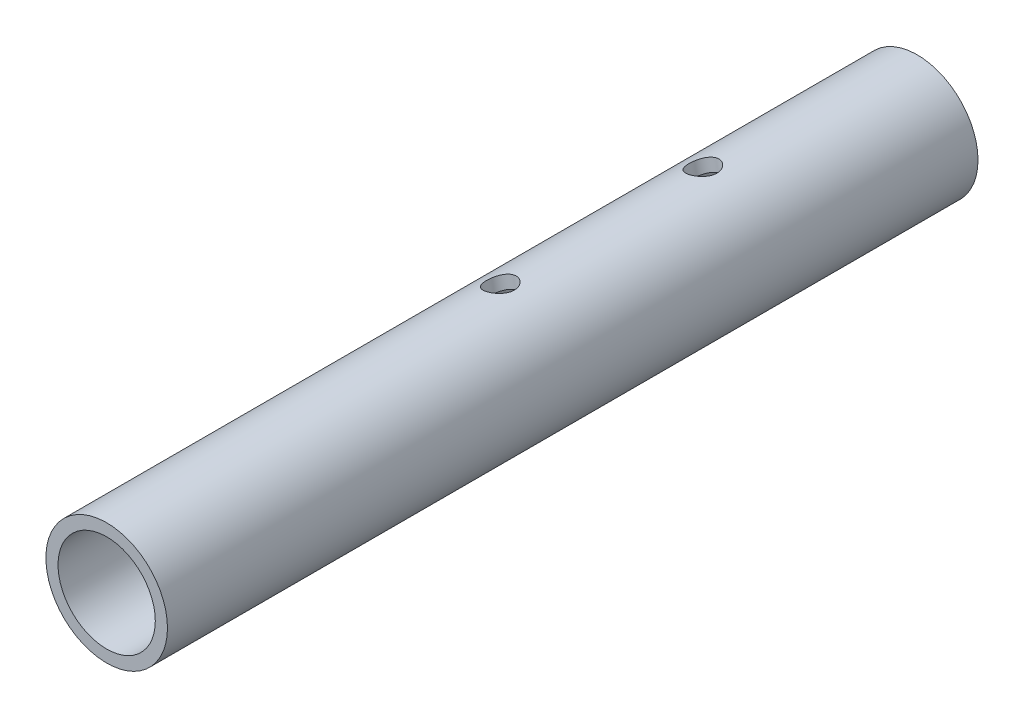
ISO-10303-21;
HEADER;
FILE_DESCRIPTION(('STEP AP214'),'2;1');
FILE_NAME('part.step','',(''),(''),'','','');
FILE_SCHEMA(('AUTOMOTIVE_DESIGN { 1 0 10303 214 1 1 1 1 }'));
ENDSEC;
DATA;
#1=APPLICATION_CONTEXT('core data for automotive mechanical design processes');
#2=APPLICATION_PROTOCOL_DEFINITION('international standard','automotive_design',2000,#1);
#3=PRODUCT_CONTEXT('',#1,'mechanical');
#4=PRODUCT('Part','Part','',(#3));
#5=PRODUCT_RELATED_PRODUCT_CATEGORY('part','',(#4));
#6=PRODUCT_DEFINITION_FORMATION('','',#4);
#7=PRODUCT_DEFINITION_CONTEXT('part definition',#1,'design');
#8=PRODUCT_DEFINITION('design','',#6,#7);
#9=PRODUCT_DEFINITION_SHAPE('','',#8);
#10=(LENGTH_UNIT() NAMED_UNIT(*) SI_UNIT(.MILLI.,.METRE.));
#11=(NAMED_UNIT(*) PLANE_ANGLE_UNIT() SI_UNIT($,.RADIAN.));
#12=(NAMED_UNIT(*) SI_UNIT($,.STERADIAN.) SOLID_ANGLE_UNIT());
#13=UNCERTAINTY_MEASURE_WITH_UNIT(LENGTH_MEASURE(1.E-05),#10,'distance_accuracy_value','');
#14=(GEOMETRIC_REPRESENTATION_CONTEXT(3) GLOBAL_UNCERTAINTY_ASSIGNED_CONTEXT((#13)) GLOBAL_UNIT_ASSIGNED_CONTEXT((#10,
#11,#12)) REPRESENTATION_CONTEXT('',''));
#15=CARTESIAN_POINT('',(0.,0.,0.));
#16=DIRECTION('',(0.,0.,1.));
#17=DIRECTION('',(1.,0.,0.));
#18=AXIS2_PLACEMENT_3D('',#15,#16,#17);
#19=CARTESIAN_POINT('',(-10.4241869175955,-1.53847980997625,200.));
#20=DIRECTION('',(0.,0.,1.));
#21=DIRECTION('',(1.,0.,0.));
#22=AXIS2_PLACEMENT_3D('',#19,#20,#21);
#23=PLANE('',#22);
#24=CARTESIAN_POINT('',(-10.4241869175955,-1.53847980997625,200.));
#25=DIRECTION('',(0.,0.,1.));
#26=DIRECTION('',(1.,0.,0.));
#27=AXIS2_PLACEMENT_3D('',#24,#25,#26);
#28=CIRCLE('',#27,15.);
#29=CARTESIAN_POINT('',(4.5758130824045,-1.53847980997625,200.));
#30=VERTEX_POINT('',#29);
#31=EDGE_CURVE('E10',#30,#30,#28,.T.);
#32=ORIENTED_EDGE('',*,*,#31,.T.);
#33=EDGE_LOOP('',(#32));
#34=FACE_BOUND('',#33,.T.);
#35=CARTESIAN_POINT('',(-10.4241869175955,-1.53847980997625,200.));
#36=DIRECTION('',(0.,0.,1.));
#37=DIRECTION('',(1.,0.,0.));
#38=AXIS2_PLACEMENT_3D('',#35,#36,#37);
#39=CIRCLE('',#38,12.);
#40=CARTESIAN_POINT('',(1.5758130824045,-1.53847980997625,200.));
#41=VERTEX_POINT('',#40);
#42=EDGE_CURVE('E46',#41,#41,#39,.T.);
#43=ORIENTED_EDGE('',*,*,#42,.F.);
#44=EDGE_LOOP('',(#43));
#45=FACE_BOUND('',#44,.T.);
#46=ADVANCED_FACE('F28',(#34,#45),#23,.T.);
#47=CARTESIAN_POINT('',(-10.4241869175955,-1.53847980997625,0.));
#48=DIRECTION('',(0.,0.,1.));
#49=DIRECTION('',(1.,0.,0.));
#50=AXIS2_PLACEMENT_3D('',#47,#48,#49);
#51=PLANE('',#50);
#52=CARTESIAN_POINT('',(-10.4241869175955,-1.53847980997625,0.));
#53=DIRECTION('',(0.,0.,1.));
#54=DIRECTION('',(1.,0.,0.));
#55=AXIS2_PLACEMENT_3D('',#52,#53,#54);
#56=CIRCLE('',#55,15.);
#57=CARTESIAN_POINT('',(4.5758130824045,-1.53847980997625,0.));
#58=VERTEX_POINT('',#57);
#59=EDGE_CURVE('E41',#58,#58,#56,.T.);
#60=ORIENTED_EDGE('',*,*,#59,.F.);
#61=EDGE_LOOP('',(#60));
#62=FACE_BOUND('',#61,.T.);
#63=CARTESIAN_POINT('',(-10.4241869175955,-1.53847980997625,0.));
#64=DIRECTION('',(0.,0.,1.));
#65=DIRECTION('',(1.,0.,0.));
#66=AXIS2_PLACEMENT_3D('',#63,#64,#65);
#67=CIRCLE('',#66,12.);
#68=CARTESIAN_POINT('',(1.5758130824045,-1.53847980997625,0.));
#69=VERTEX_POINT('',#68);
#70=EDGE_CURVE('E49',#69,#69,#67,.T.);
#71=ORIENTED_EDGE('',*,*,#70,.T.);
#72=EDGE_LOOP('',(#71));
#73=FACE_BOUND('',#72,.T.);
#74=ADVANCED_FACE('F96',(#62,#73),#51,.F.);
#75=CARTESIAN_POINT('',(-10.4241869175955,-1.53847980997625,200.));
#76=DIRECTION('',(0.,0.,-1.));
#77=DIRECTION('',(-1.,0.,0.));
#78=AXIS2_PLACEMENT_3D('',#75,#76,#77);
#79=CYLINDRICAL_SURFACE('',#78,15.);
#80=CARTESIAN_POINT('',(-9.83998223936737,13.4501393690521,50.));
#81=CARTESIAN_POINT('',(-9.83998905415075,13.4501419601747,50.1937031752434));
#82=CARTESIAN_POINT('',(-9.85656845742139,13.4508140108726,50.3874778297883));
#83=CARTESIAN_POINT('',(-9.92229594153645,13.4531561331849,50.7694922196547));
#84=CARTESIAN_POINT('',(-9.97146548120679,13.4548268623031,50.9577282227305));
#85=CARTESIAN_POINT('',(-10.1005320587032,13.4581658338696,51.3230843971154));
#86=CARTESIAN_POINT('',(-10.1803927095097,13.4598340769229,51.5002174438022));
#87=CARTESIAN_POINT('',(-10.3681859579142,13.4617083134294,51.8388950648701));
#88=CARTESIAN_POINT('',(-10.4761187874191,13.4619142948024,52.0004395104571));
#89=CARTESIAN_POINT('',(-10.718856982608,13.4591238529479,52.3064561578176));
#90=CARTESIAN_POINT('',(-10.8540943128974,13.4560720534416,52.4505852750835));
#91=CARTESIAN_POINT('',(-11.1462470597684,13.4448430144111,52.7146672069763));
#92=CARTESIAN_POINT('',(-11.30316430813,13.4366653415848,52.8346179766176));
#93=CARTESIAN_POINT('',(-11.6361929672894,13.4134161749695,53.0483164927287));
#94=CARTESIAN_POINT('',(-11.8125128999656,13.3982627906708,53.1417310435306));
#95=CARTESIAN_POINT('',(-12.1775393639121,13.359821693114,53.2975449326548));
#96=CARTESIAN_POINT('',(-12.3662443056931,13.3365350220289,53.359948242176));
#97=CARTESIAN_POINT('',(-12.7469089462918,13.2818192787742,53.4508801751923));
#98=CARTESIAN_POINT('',(-12.9387514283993,13.2505420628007,53.4799903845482));
#99=CARTESIAN_POINT('',(-13.32313110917,13.1800214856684,53.5053314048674));
#100=CARTESIAN_POINT('',(-13.5156682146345,13.140779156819,53.5015664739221));
#101=CARTESIAN_POINT('',(-13.8920620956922,13.0563941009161,53.4616905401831));
#102=CARTESIAN_POINT('',(-14.0760147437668,13.0113802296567,53.4262067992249));
#103=CARTESIAN_POINT('',(-14.4341227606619,12.9167868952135,53.3249039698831));
#104=CARTESIAN_POINT('',(-14.6082776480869,12.8672072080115,53.2590833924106));
#105=CARTESIAN_POINT('',(-14.9437099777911,12.7655372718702,53.0984420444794));
#106=CARTESIAN_POINT('',(-15.1048713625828,12.7134299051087,53.0033901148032));
#107=CARTESIAN_POINT('',(-15.4088756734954,12.6099724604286,52.7871578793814));
#108=CARTESIAN_POINT('',(-15.5517157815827,12.5586225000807,52.6659735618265));
#109=CARTESIAN_POINT('',(-15.8189204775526,12.4585810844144,52.3975246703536));
#110=CARTESIAN_POINT('',(-15.9427685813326,12.4099811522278,52.2497113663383));
#111=CARTESIAN_POINT('',(-16.1648533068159,12.3200607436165,51.933976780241));
#112=CARTESIAN_POINT('',(-16.2630890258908,12.2787405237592,51.7660547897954));
#113=CARTESIAN_POINT('',(-16.431780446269,12.2062399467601,51.4139407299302));
#114=CARTESIAN_POINT('',(-16.5021304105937,12.175098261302,51.2296899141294));
#115=CARTESIAN_POINT('',(-16.6125551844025,12.1256263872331,50.8506990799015));
#116=CARTESIAN_POINT('',(-16.6526355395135,12.1072938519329,50.6559609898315));
#117=CARTESIAN_POINT('',(-16.7007781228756,12.0852162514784,50.2663477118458));
#118=CARTESIAN_POINT('',(-16.7095591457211,12.081143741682,50.071579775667));
#119=CARTESIAN_POINT('',(-16.6968479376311,12.0870026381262,49.683258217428));
#120=CARTESIAN_POINT('',(-16.6753581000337,12.0969329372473,49.489704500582));
#121=CARTESIAN_POINT('',(-16.6032479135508,12.1297579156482,49.1120624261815));
#122=CARTESIAN_POINT('',(-16.5530343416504,12.1524714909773,48.9278802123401));
#123=CARTESIAN_POINT('',(-16.4251452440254,12.20900566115,48.5711259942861));
#124=CARTESIAN_POINT('',(-16.3474667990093,12.2428274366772,48.398555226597));
#125=CARTESIAN_POINT('',(-16.1650090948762,12.3198353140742,48.0666264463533));
#126=CARTESIAN_POINT('',(-16.0597835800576,12.3631735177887,47.9075491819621));
#127=CARTESIAN_POINT('',(-15.825416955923,12.4558962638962,47.610107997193));
#128=CARTESIAN_POINT('',(-15.6962724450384,12.5052816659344,47.4717470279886));
#129=CARTESIAN_POINT('',(-15.4140349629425,12.6080536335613,47.2166229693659));
#130=CARTESIAN_POINT('',(-15.2604871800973,12.6615033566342,47.100387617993));
#131=CARTESIAN_POINT('',(-14.9353056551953,12.7681285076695,46.896614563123));
#132=CARTESIAN_POINT('',(-14.7636728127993,12.8213039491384,46.8090754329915));
#133=CARTESIAN_POINT('',(-14.4080228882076,12.9239902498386,46.6658852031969));
#134=CARTESIAN_POINT('',(-14.2240996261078,12.9735239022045,46.6100178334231));
#135=CARTESIAN_POINT('',(-13.8479495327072,13.0668397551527,46.5310920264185));
#136=CARTESIAN_POINT('',(-13.6557240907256,13.1106229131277,46.5080281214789));
#137=CARTESIAN_POINT('',(-13.2732187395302,13.1897335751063,46.495637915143));
#138=CARTESIAN_POINT('',(-13.0830000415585,13.2252363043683,46.5055279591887));
#139=CARTESIAN_POINT('',(-12.7055607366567,13.2882510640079,46.5569930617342));
#140=CARTESIAN_POINT('',(-12.5183400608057,13.3157632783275,46.5985673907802));
#141=CARTESIAN_POINT('',(-12.1530623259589,13.3626875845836,46.7118242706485));
#142=CARTESIAN_POINT('',(-11.9749706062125,13.3821326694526,46.7833817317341));
#143=CARTESIAN_POINT('',(-11.6320749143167,13.4138006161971,46.9544565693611));
#144=CARTESIAN_POINT('',(-11.4672724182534,13.4260226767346,47.0539770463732));
#145=CARTESIAN_POINT('',(-11.1521415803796,13.4446958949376,47.2806336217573));
#146=CARTESIAN_POINT('',(-11.0021958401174,13.4510187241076,47.4083122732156));
#147=CARTESIAN_POINT('',(-10.7251242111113,13.4591431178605,47.686584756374));
#148=CARTESIAN_POINT('',(-10.5980039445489,13.4609435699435,47.8371842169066));
#149=CARTESIAN_POINT('',(-10.3686238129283,13.4618638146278,48.1598665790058));
#150=CARTESIAN_POINT('',(-10.2667851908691,13.4609411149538,48.3322494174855));
#151=CARTESIAN_POINT('',(-10.0940617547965,13.4581376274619,48.6917810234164));
#152=CARTESIAN_POINT('',(-10.023152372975,13.4562576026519,48.8789179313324));
#153=CARTESIAN_POINT('',(-9.92630325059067,13.453314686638,49.2216875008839));
#154=CARTESIAN_POINT('',(-9.8940059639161,13.4521630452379,49.3755530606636));
#155=CARTESIAN_POINT('',(-9.85084337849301,13.4505743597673,49.6862635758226));
#156=CARTESIAN_POINT('',(-9.83997671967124,13.4501372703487,49.8431083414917));
#157=CARTESIAN_POINT('',(-9.83998223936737,13.4501393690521,50.));
#158=B_SPLINE_CURVE_WITH_KNOTS('',3,(#80,#81,#82,#83,#84,#85,#86,#87,#88,#89,#90,#91,#92,#93,
#94,#95,#96,#97,#98,#99,#100,#101,#102,#103,#104,#105,#106,#107,#108,#109,#110,#111,#112,#113,
#114,#115,#116,#117,#118,#119,#120,#121,#122,#123,#124,#125,#126,#127,#128,#129,#130,#131,#132,
#133,#134,#135,#136,#137,#138,#139,#140,#141,#142,#143,#144,#145,#146,#147,#148,#149,#150,#151,
#152,#153,#154,#155,#156,#157),.UNSPECIFIED.,.T.,.F.,(4,2,2,2,2,2,2,2,2,2,2,2,2,2,2,2,2,2,2,2,2,
2,2,2,2,2,2,2,2,2,2,2,2,2,2,2,2,2,4),(0.,0.580534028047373,1.16145068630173,1.7416807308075,
2.32191556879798,2.91217274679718,3.50247982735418,4.09990075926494,4.69724516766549,
5.28398725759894,5.87065335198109,6.44596825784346,7.02131140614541,7.60132670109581,
8.18143110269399,8.7752467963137,9.36908341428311,9.96515067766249,10.5611087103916,
11.1432889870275,11.7254232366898,12.2995106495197,12.873659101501,13.457755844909,
14.0419357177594,14.6386632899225,15.2353611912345,15.8279338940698,16.4204078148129,
16.9988940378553,17.5773669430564,18.1534501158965,18.7295971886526,19.3180036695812,
19.9065548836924,20.5043382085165,21.1016458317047,21.5718845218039,22.0420933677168),.UNSPECIFIED.);
#159=CARTESIAN_POINT('',(-9.83998223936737,13.4501393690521,50.));
#160=VERTEX_POINT('',#159);
#161=EDGE_CURVE('E59',#160,#160,#158,.T.);
#162=ORIENTED_EDGE('',*,*,#161,.T.);
#163=EDGE_LOOP('',(#162));
#164=FACE_BOUND('',#163,.T.);
#165=CARTESIAN_POINT('',(-4.1431649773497,-15.1601083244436,50.));
#166=CARTESIAN_POINT('',(-4.14317027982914,-15.1601133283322,49.8062968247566));
#167=CARTESIAN_POINT('',(-4.15822771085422,-15.1670848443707,49.6125221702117));
#168=CARTESIAN_POINT('',(-4.21804488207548,-15.1944251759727,49.2305077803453));
#169=CARTESIAN_POINT('',(-4.26282419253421,-15.214802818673,49.0422717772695));
#170=CARTESIAN_POINT('',(-4.38076761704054,-15.2673259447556,48.6769156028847));
#171=CARTESIAN_POINT('',(-4.4538981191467,-15.299457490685,48.4997825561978));
#172=CARTESIAN_POINT('',(-4.62665008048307,-15.3731227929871,48.1611049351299));
#173=CARTESIAN_POINT('',(-4.72627175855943,-15.4146566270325,47.9995604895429));
#174=CARTESIAN_POINT('',(-4.95156470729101,-15.5050596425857,47.6935438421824));
#175=CARTESIAN_POINT('',(-5.07765620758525,-15.5540431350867,47.5494147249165));
#176=CARTESIAN_POINT('',(-5.35182715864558,-15.6555793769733,47.2853327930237));
#177=CARTESIAN_POINT('',(-5.49990846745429,-15.7081324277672,47.1653820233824));
#178=CARTESIAN_POINT('',(-5.81644194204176,-15.8142228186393,46.9516835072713));
#179=CARTESIAN_POINT('',(-5.98511809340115,-15.8677643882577,46.8582689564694));
#180=CARTESIAN_POINT('',(-6.33702809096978,-15.9720782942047,46.7024550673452));
#181=CARTESIAN_POINT('',(-6.52026006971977,-16.0228509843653,46.6400517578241));
#182=CARTESIAN_POINT('',(-6.89284947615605,-16.1181217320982,46.5491198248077));
#183=CARTESIAN_POINT('',(-7.08204045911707,-16.1627151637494,46.5200096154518));
#184=CARTESIAN_POINT('',(-7.46411557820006,-16.2448095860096,46.4946685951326));
#185=CARTESIAN_POINT('',(-7.6569992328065,-16.2823114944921,46.4984335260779));
#186=CARTESIAN_POINT('',(-8.03700841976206,-16.3485399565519,46.5383094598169));
#187=CARTESIAN_POINT('',(-8.22417315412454,-16.3774222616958,46.5737932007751));
#188=CARTESIAN_POINT('',(-8.59120144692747,-16.4272166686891,46.6750960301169));
#189=CARTESIAN_POINT('',(-8.77106464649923,-16.4481283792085,46.7409166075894));
#190=CARTESIAN_POINT('',(-9.11985745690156,-16.4827000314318,46.9015579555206));
#191=CARTESIAN_POINT('',(-9.2886864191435,-16.4962997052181,46.9966098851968));
#192=CARTESIAN_POINT('',(-9.60913299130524,-16.5171817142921,47.2128421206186));
#193=CARTESIAN_POINT('',(-9.76074795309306,-16.5244630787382,47.3340264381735));
#194=CARTESIAN_POINT('',(-10.0458931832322,-16.5344045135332,47.6024753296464));
#195=CARTESIAN_POINT('',(-10.1789113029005,-16.5369512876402,47.7502886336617));
#196=CARTESIAN_POINT('',(-10.4185011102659,-16.5389586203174,48.066023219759));
#197=CARTESIAN_POINT('',(-10.5250718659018,-16.538419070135,48.2339452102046));
#198=CARTESIAN_POINT('',(-10.7086681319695,-16.5360653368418,48.5860592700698));
#199=CARTESIAN_POINT('',(-10.7855811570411,-16.534246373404,48.7703100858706));
#200=CARTESIAN_POINT('',(-10.9065337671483,-16.5308459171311,49.1493009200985));
#201=CARTESIAN_POINT('',(-10.9505793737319,-16.5292643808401,49.3440390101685));
#202=CARTESIAN_POINT('',(-11.003506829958,-16.5273116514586,49.7336522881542));
#203=CARTESIAN_POINT('',(-11.0131780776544,-16.5269133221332,49.9284202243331));
#204=CARTESIAN_POINT('',(-10.9991921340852,-16.5274563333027,50.316741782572));
#205=CARTESIAN_POINT('',(-10.9755375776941,-16.5283975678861,50.510295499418));
#206=CARTESIAN_POINT('',(-10.8963538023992,-16.5310971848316,50.8879375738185));
#207=CARTESIAN_POINT('',(-10.8412697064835,-16.5328440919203,51.0721197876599));
#208=CARTESIAN_POINT('',(-10.7014796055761,-16.536078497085,51.4288740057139));
#209=CARTESIAN_POINT('',(-10.6167704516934,-16.53756596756,51.601444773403));
#210=CARTESIAN_POINT('',(-10.4187313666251,-16.5388100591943,51.9333735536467));
#211=CARTESIAN_POINT('',(-10.3049309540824,-16.538536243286,52.0924508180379));
#212=CARTESIAN_POINT('',(-10.0529225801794,-16.5344129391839,52.389892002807));
#213=CARTESIAN_POINT('',(-9.91471114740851,-16.5305629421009,52.5282529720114));
#214=CARTESIAN_POINT('',(-9.61463377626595,-16.5173855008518,52.7833770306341));
#215=CARTESIAN_POINT('',(-9.45232352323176,-16.5079421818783,52.899612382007));
#216=CARTESIAN_POINT('',(-9.1111015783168,-16.4818743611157,53.103385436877));
#217=CARTESIAN_POINT('',(-8.93219071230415,-16.4652502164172,53.1909245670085));
#218=CARTESIAN_POINT('',(-8.56433302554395,-16.4238730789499,53.3341147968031));
#219=CARTESIAN_POINT('',(-8.37546413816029,-16.3991770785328,53.3899821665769));
#220=CARTESIAN_POINT('',(-7.99225921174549,-16.341291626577,53.4689079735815));
#221=CARTESIAN_POINT('',(-7.79792408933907,-16.308103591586,53.4919718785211));
#222=CARTESIAN_POINT('',(-7.41428991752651,-16.2346620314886,53.504362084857));
#223=CARTESIAN_POINT('',(-7.22498029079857,-16.1945938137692,53.4944720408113));
#224=CARTESIAN_POINT('',(-6.85219128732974,-16.10822456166,53.4430069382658));
#225=CARTESIAN_POINT('',(-6.66871177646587,-16.0619236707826,53.4014326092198));
#226=CARTESIAN_POINT('',(-6.31332018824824,-15.965349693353,53.2881757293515));
#227=CARTESIAN_POINT('',(-6.14136345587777,-15.9150938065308,53.2166182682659));
#228=CARTESIAN_POINT('',(-5.81249072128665,-15.8130005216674,53.0455434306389));
#229=CARTESIAN_POINT('',(-5.65557638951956,-15.7611629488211,52.9460229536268));
#230=CARTESIAN_POINT('',(-5.35732844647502,-15.6577013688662,52.7193663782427));
#231=CARTESIAN_POINT('',(-5.21639741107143,-15.606105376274,52.5916877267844));
#232=CARTESIAN_POINT('',(-4.95734654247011,-15.5074780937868,52.313415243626));
#233=CARTESIAN_POINT('',(-4.83923232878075,-15.4604479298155,52.1628157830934));
#234=CARTESIAN_POINT('',(-4.62699497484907,-15.3734341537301,51.8401334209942));
#235=CARTESIAN_POINT('',(-4.53327722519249,-15.3335726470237,51.6677505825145));
#236=CARTESIAN_POINT('',(-4.37480162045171,-15.2648214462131,51.3082189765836));
#237=CARTESIAN_POINT('',(-4.31002077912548,-15.2359230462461,51.1210820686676));
#238=CARTESIAN_POINT('',(-4.22168581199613,-15.1961066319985,50.7783124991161));
#239=CARTESIAN_POINT('',(-4.19229303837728,-15.1826713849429,50.6244469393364));
#240=CARTESIAN_POINT('',(-4.15303109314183,-15.1646704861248,50.3137364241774));
#241=CARTESIAN_POINT('',(-4.14316068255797,-15.1601042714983,50.1568916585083));
#242=CARTESIAN_POINT('',(-4.1431649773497,-15.1601083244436,50.));
#243=B_SPLINE_CURVE_WITH_KNOTS('',3,(#165,#166,#167,#168,#169,#170,#171,#172,#173,#174,#175,
#176,#177,#178,#179,#180,#181,#182,#183,#184,#185,#186,#187,#188,#189,#190,#191,#192,#193,#194,
#195,#196,#197,#198,#199,#200,#201,#202,#203,#204,#205,#206,#207,#208,#209,#210,#211,#212,#213,
#214,#215,#216,#217,#218,#219,#220,#221,#222,#223,#224,#225,#226,#227,#228,#229,#230,#231,#232,
#233,#234,#235,#236,#237,#238,#239,#240,#241,#242),.UNSPECIFIED.,.T.,.F.,(4,2,2,2,2,2,2,2,2,2,2,
2,2,2,2,2,2,2,2,2,2,2,2,2,2,2,2,2,2,2,2,2,2,2,2,2,2,2,4),(0.,0.580534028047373,1.16145068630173,
1.7416807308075,2.32191556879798,2.9121727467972,3.50247982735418,4.09990075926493,
4.69724516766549,5.28398725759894,5.87065335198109,6.44596825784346,7.02131140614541,
7.60132670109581,8.18143110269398,8.77524679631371,9.36908341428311,9.96515067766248,
10.5611087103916,11.1432889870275,11.7254232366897,12.2995106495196,12.873659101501,
13.457755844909,14.0419357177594,14.6386632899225,15.2353611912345,15.8279338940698,
16.4204078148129,16.9988940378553,17.5773669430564,18.1534501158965,18.7295971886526,
19.3180036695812,19.9065548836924,20.5043382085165,21.1016458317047,21.571884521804,
22.0420933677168),.UNSPECIFIED.);
#244=CARTESIAN_POINT('',(-4.1431649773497,-15.1601083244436,50.));
#245=VERTEX_POINT('',#244);
#246=EDGE_CURVE('E162',#245,#245,#243,.T.);
#247=ORIENTED_EDGE('',*,*,#246,.T.);
#248=EDGE_LOOP('',(#247));
#249=FACE_BOUND('',#248,.T.);
#250=CARTESIAN_POINT('',(-9.83998223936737,13.4501393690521,100.));
#251=CARTESIAN_POINT('',(-9.83998905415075,13.4501419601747,100.193703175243));
#252=CARTESIAN_POINT('',(-9.85656845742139,13.4508140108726,100.387477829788));
#253=CARTESIAN_POINT('',(-9.92229594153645,13.4531561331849,100.769492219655));
#254=CARTESIAN_POINT('',(-9.97146548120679,13.4548268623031,100.95772822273));
#255=CARTESIAN_POINT('',(-10.1005320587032,13.4581658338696,101.323084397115));
#256=CARTESIAN_POINT('',(-10.1803927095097,13.4598340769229,101.500217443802));
#257=CARTESIAN_POINT('',(-10.3681859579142,13.4617083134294,101.83889506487));
#258=CARTESIAN_POINT('',(-10.4761187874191,13.4619142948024,102.000439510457));
#259=CARTESIAN_POINT('',(-10.718856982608,13.4591238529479,102.306456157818));
#260=CARTESIAN_POINT('',(-10.8540943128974,13.4560720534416,102.450585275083));
#261=CARTESIAN_POINT('',(-11.1462470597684,13.4448430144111,102.714667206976));
#262=CARTESIAN_POINT('',(-11.30316430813,13.4366653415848,102.834617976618));
#263=CARTESIAN_POINT('',(-11.6361929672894,13.4134161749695,103.048316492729));
#264=CARTESIAN_POINT('',(-11.8125128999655,13.3982627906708,103.141731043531));
#265=CARTESIAN_POINT('',(-12.1775393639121,13.359821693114,103.297544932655));
#266=CARTESIAN_POINT('',(-12.366244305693,13.3365350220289,103.359948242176));
#267=CARTESIAN_POINT('',(-12.7469089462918,13.2818192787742,103.450880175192));
#268=CARTESIAN_POINT('',(-12.9387514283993,13.2505420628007,103.479990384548));
#269=CARTESIAN_POINT('',(-13.32313110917,13.1800214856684,103.505331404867));
#270=CARTESIAN_POINT('',(-13.5156682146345,13.140779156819,103.501566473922));
#271=CARTESIAN_POINT('',(-13.8920620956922,13.0563941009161,103.461690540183));
#272=CARTESIAN_POINT('',(-14.0760147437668,13.0113802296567,103.426206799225));
#273=CARTESIAN_POINT('',(-14.4341227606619,12.9167868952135,103.324903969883));
#274=CARTESIAN_POINT('',(-14.6082776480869,12.8672072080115,103.259083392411));
#275=CARTESIAN_POINT('',(-14.9437099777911,12.7655372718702,103.098442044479));
#276=CARTESIAN_POINT('',(-15.1048713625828,12.7134299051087,103.003390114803));
#277=CARTESIAN_POINT('',(-15.4088756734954,12.6099724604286,102.787157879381));
#278=CARTESIAN_POINT('',(-15.5517157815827,12.5586225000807,102.665973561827));
#279=CARTESIAN_POINT('',(-15.8189204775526,12.4585810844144,102.397524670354));
#280=CARTESIAN_POINT('',(-15.9427685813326,12.4099811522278,102.249711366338));
#281=CARTESIAN_POINT('',(-16.1648533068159,12.3200607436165,101.933976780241));
#282=CARTESIAN_POINT('',(-16.2630890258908,12.2787405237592,101.766054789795));
#283=CARTESIAN_POINT('',(-16.431780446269,12.2062399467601,101.41394072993));
#284=CARTESIAN_POINT('',(-16.5021304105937,12.175098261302,101.229689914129));
#285=CARTESIAN_POINT('',(-16.6125551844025,12.1256263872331,100.850699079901));
#286=CARTESIAN_POINT('',(-16.6526355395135,12.1072938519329,100.655960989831));
#287=CARTESIAN_POINT('',(-16.7007781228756,12.0852162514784,100.266347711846));
#288=CARTESIAN_POINT('',(-16.7095591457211,12.081143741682,100.071579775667));
#289=CARTESIAN_POINT('',(-16.6968479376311,12.0870026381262,99.683258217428));
#290=CARTESIAN_POINT('',(-16.6753581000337,12.0969329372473,99.4897045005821));
#291=CARTESIAN_POINT('',(-16.6032479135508,12.1297579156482,99.1120624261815));
#292=CARTESIAN_POINT('',(-16.5530343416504,12.1524714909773,98.9278802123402));
#293=CARTESIAN_POINT('',(-16.4251452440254,12.20900566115,98.5711259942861));
#294=CARTESIAN_POINT('',(-16.3474667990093,12.2428274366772,98.398555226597));
#295=CARTESIAN_POINT('',(-16.1650090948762,12.3198353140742,98.0666264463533));
#296=CARTESIAN_POINT('',(-16.0597835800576,12.3631735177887,97.9075491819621));
#297=CARTESIAN_POINT('',(-15.825416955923,12.4558962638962,97.610107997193));
#298=CARTESIAN_POINT('',(-15.6962724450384,12.5052816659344,97.4717470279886));
#299=CARTESIAN_POINT('',(-15.4140349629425,12.6080536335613,97.2166229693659));
#300=CARTESIAN_POINT('',(-15.2604871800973,12.6615033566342,97.100387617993));
#301=CARTESIAN_POINT('',(-14.9353056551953,12.7681285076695,96.896614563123));
#302=CARTESIAN_POINT('',(-14.7636728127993,12.8213039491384,96.8090754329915));
#303=CARTESIAN_POINT('',(-14.4080228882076,12.9239902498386,96.6658852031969));
#304=CARTESIAN_POINT('',(-14.2240996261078,12.9735239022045,96.6100178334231));
#305=CARTESIAN_POINT('',(-13.8479495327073,13.0668397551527,96.5310920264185));
#306=CARTESIAN_POINT('',(-13.6557240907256,13.1106229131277,96.508028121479));
#307=CARTESIAN_POINT('',(-13.2732187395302,13.1897335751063,96.495637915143));
#308=CARTESIAN_POINT('',(-13.0830000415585,13.2252363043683,96.5055279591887));
#309=CARTESIAN_POINT('',(-12.7055607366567,13.2882510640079,96.5569930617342));
#310=CARTESIAN_POINT('',(-12.5183400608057,13.3157632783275,96.5985673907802));
#311=CARTESIAN_POINT('',(-12.1530623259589,13.3626875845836,96.7118242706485));
#312=CARTESIAN_POINT('',(-11.9749706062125,13.3821326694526,96.7833817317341));
#313=CARTESIAN_POINT('',(-11.6320749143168,13.4138006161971,96.9544565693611));
#314=CARTESIAN_POINT('',(-11.4672724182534,13.4260226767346,97.0539770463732));
#315=CARTESIAN_POINT('',(-11.1521415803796,13.4446958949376,97.2806336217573));
#316=CARTESIAN_POINT('',(-11.0021958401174,13.4510187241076,97.4083122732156));
#317=CARTESIAN_POINT('',(-10.7251242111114,13.4591431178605,97.686584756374));
#318=CARTESIAN_POINT('',(-10.5980039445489,13.4609435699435,97.8371842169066));
#319=CARTESIAN_POINT('',(-10.3686238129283,13.4618638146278,98.1598665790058));
#320=CARTESIAN_POINT('',(-10.2667851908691,13.4609411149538,98.3322494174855));
#321=CARTESIAN_POINT('',(-10.0940617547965,13.4581376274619,98.6917810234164));
#322=CARTESIAN_POINT('',(-10.023152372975,13.4562576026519,98.8789179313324));
#323=CARTESIAN_POINT('',(-9.92630325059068,13.453314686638,99.2216875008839));
#324=CARTESIAN_POINT('',(-9.8940059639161,13.4521630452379,99.3755530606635));
#325=CARTESIAN_POINT('',(-9.85084337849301,13.4505743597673,99.6862635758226));
#326=CARTESIAN_POINT('',(-9.83997671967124,13.4501372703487,99.8431083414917));
#327=CARTESIAN_POINT('',(-9.83998223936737,13.4501393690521,100.));
#328=B_SPLINE_CURVE_WITH_KNOTS('',3,(#250,#251,#252,#253,#254,#255,#256,#257,#258,#259,#260,
#261,#262,#263,#264,#265,#266,#267,#268,#269,#270,#271,#272,#273,#274,#275,#276,#277,#278,#279,
#280,#281,#282,#283,#284,#285,#286,#287,#288,#289,#290,#291,#292,#293,#294,#295,#296,#297,#298,
#299,#300,#301,#302,#303,#304,#305,#306,#307,#308,#309,#310,#311,#312,#313,#314,#315,#316,#317,
#318,#319,#320,#321,#322,#323,#324,#325,#326,#327),.UNSPECIFIED.,.T.,.F.,(4,2,2,2,2,2,2,2,2,2,2,
2,2,2,2,2,2,2,2,2,2,2,2,2,2,2,2,2,2,2,2,2,2,2,2,2,2,2,4),(0.,0.580534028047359,1.16145068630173,
1.74168073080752,2.32191556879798,2.91217274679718,3.50247982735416,4.09990075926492,
4.69724516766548,5.28398725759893,5.87065335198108,6.44596825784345,7.0213114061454,
7.6013267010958,8.18143110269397,8.7752467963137,9.36908341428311,9.96515067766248,
10.5611087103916,11.1432889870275,11.7254232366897,12.2995106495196,12.873659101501,
13.457755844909,14.0419357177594,14.6386632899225,15.2353611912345,15.8279338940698,
16.4204078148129,16.9988940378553,17.5773669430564,18.1534501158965,18.7295971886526,
19.3180036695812,19.9065548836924,20.5043382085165,21.1016458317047,21.5718845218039,
22.0420933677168),.UNSPECIFIED.);
#329=CARTESIAN_POINT('',(-9.83998223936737,13.4501393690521,100.));
#330=VERTEX_POINT('',#329);
#331=EDGE_CURVE('E83',#330,#330,#328,.T.);
#332=ORIENTED_EDGE('',*,*,#331,.T.);
#333=EDGE_LOOP('',(#332));
#334=FACE_BOUND('',#333,.T.);
#335=CARTESIAN_POINT('',(-4.1431649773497,-15.1601083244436,100.));
#336=CARTESIAN_POINT('',(-4.14317027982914,-15.1601133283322,99.8062968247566));
#337=CARTESIAN_POINT('',(-4.15822771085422,-15.1670848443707,99.6125221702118));
#338=CARTESIAN_POINT('',(-4.21804488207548,-15.1944251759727,99.2305077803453));
#339=CARTESIAN_POINT('',(-4.26282419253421,-15.214802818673,99.0422717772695));
#340=CARTESIAN_POINT('',(-4.38076761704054,-15.2673259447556,98.6769156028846));
#341=CARTESIAN_POINT('',(-4.4538981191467,-15.299457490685,98.4997825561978));
#342=CARTESIAN_POINT('',(-4.62665008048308,-15.3731227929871,98.1611049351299));
#343=CARTESIAN_POINT('',(-4.72627175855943,-15.4146566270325,97.9995604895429));
#344=CARTESIAN_POINT('',(-4.95156470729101,-15.5050596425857,97.6935438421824));
#345=CARTESIAN_POINT('',(-5.07765620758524,-15.5540431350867,97.5494147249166));
#346=CARTESIAN_POINT('',(-5.35182715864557,-15.6555793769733,97.2853327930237));
#347=CARTESIAN_POINT('',(-5.49990846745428,-15.7081324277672,97.1653820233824));
#348=CARTESIAN_POINT('',(-5.81644194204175,-15.8142228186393,96.9516835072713));
#349=CARTESIAN_POINT('',(-5.98511809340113,-15.8677643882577,96.8582689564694));
#350=CARTESIAN_POINT('',(-6.33702809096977,-15.9720782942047,96.7024550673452));
#351=CARTESIAN_POINT('',(-6.52026006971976,-16.0228509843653,96.6400517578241));
#352=CARTESIAN_POINT('',(-6.89284947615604,-16.1181217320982,96.5491198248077));
#353=CARTESIAN_POINT('',(-7.08204045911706,-16.1627151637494,96.5200096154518));
#354=CARTESIAN_POINT('',(-7.46411557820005,-16.2448095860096,96.4946685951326));
#355=CARTESIAN_POINT('',(-7.65699923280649,-16.2823114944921,96.4984335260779));
#356=CARTESIAN_POINT('',(-8.03700841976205,-16.3485399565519,96.5383094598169));
#357=CARTESIAN_POINT('',(-8.22417315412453,-16.3774222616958,96.5737932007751));
#358=CARTESIAN_POINT('',(-8.59120144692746,-16.4272166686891,96.6750960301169));
#359=CARTESIAN_POINT('',(-8.77106464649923,-16.4481283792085,96.7409166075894));
#360=CARTESIAN_POINT('',(-9.11985745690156,-16.4827000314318,96.9015579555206));
#361=CARTESIAN_POINT('',(-9.28868641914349,-16.4962997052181,96.9966098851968));
#362=CARTESIAN_POINT('',(-9.60913299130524,-16.5171817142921,97.2128421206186));
#363=CARTESIAN_POINT('',(-9.76074795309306,-16.5244630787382,97.3340264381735));
#364=CARTESIAN_POINT('',(-10.0458931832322,-16.5344045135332,97.6024753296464));
#365=CARTESIAN_POINT('',(-10.1789113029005,-16.5369512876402,97.7502886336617));
#366=CARTESIAN_POINT('',(-10.4185011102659,-16.5389586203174,98.066023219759));
#367=CARTESIAN_POINT('',(-10.5250718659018,-16.538419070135,98.2339452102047));
#368=CARTESIAN_POINT('',(-10.7086681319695,-16.5360653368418,98.5860592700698));
#369=CARTESIAN_POINT('',(-10.7855811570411,-16.534246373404,98.7703100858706));
#370=CARTESIAN_POINT('',(-10.9065337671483,-16.5308459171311,99.1493009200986));
#371=CARTESIAN_POINT('',(-10.9505793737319,-16.5292643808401,99.3440390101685));
#372=CARTESIAN_POINT('',(-11.003506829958,-16.5273116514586,99.7336522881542));
#373=CARTESIAN_POINT('',(-11.0131780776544,-16.5269133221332,99.9284202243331));
#374=CARTESIAN_POINT('',(-10.9991921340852,-16.5274563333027,100.316741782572));
#375=CARTESIAN_POINT('',(-10.9755375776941,-16.5283975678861,100.510295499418));
#376=CARTESIAN_POINT('',(-10.8963538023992,-16.5310971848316,100.887937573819));
#377=CARTESIAN_POINT('',(-10.8412697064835,-16.5328440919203,101.07211978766));
#378=CARTESIAN_POINT('',(-10.7014796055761,-16.536078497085,101.428874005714));
#379=CARTESIAN_POINT('',(-10.6167704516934,-16.53756596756,101.601444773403));
#380=CARTESIAN_POINT('',(-10.4187313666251,-16.5388100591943,101.933373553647));
#381=CARTESIAN_POINT('',(-10.3049309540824,-16.538536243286,102.092450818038));
#382=CARTESIAN_POINT('',(-10.0529225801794,-16.5344129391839,102.389892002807));
#383=CARTESIAN_POINT('',(-9.91471114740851,-16.5305629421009,102.528252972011));
#384=CARTESIAN_POINT('',(-9.61463377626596,-16.5173855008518,102.783377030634));
#385=CARTESIAN_POINT('',(-9.45232352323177,-16.5079421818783,102.899612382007));
#386=CARTESIAN_POINT('',(-9.11110157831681,-16.4818743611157,103.103385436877));
#387=CARTESIAN_POINT('',(-8.93219071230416,-16.4652502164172,103.190924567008));
#388=CARTESIAN_POINT('',(-8.56433302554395,-16.4238730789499,103.334114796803));
#389=CARTESIAN_POINT('',(-8.37546413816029,-16.3991770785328,103.389982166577));
#390=CARTESIAN_POINT('',(-7.9922592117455,-16.341291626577,103.468907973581));
#391=CARTESIAN_POINT('',(-7.79792408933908,-16.308103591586,103.491971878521));
#392=CARTESIAN_POINT('',(-7.41428991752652,-16.2346620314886,103.504362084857));
#393=CARTESIAN_POINT('',(-7.22498029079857,-16.1945938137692,103.494472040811));
#394=CARTESIAN_POINT('',(-6.85219128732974,-16.10822456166,103.443006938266));
#395=CARTESIAN_POINT('',(-6.66871177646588,-16.0619236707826,103.40143260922));
#396=CARTESIAN_POINT('',(-6.31332018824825,-15.965349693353,103.288175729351));
#397=CARTESIAN_POINT('',(-6.14136345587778,-15.9150938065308,103.216618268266));
#398=CARTESIAN_POINT('',(-5.81249072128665,-15.8130005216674,103.045543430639));
#399=CARTESIAN_POINT('',(-5.65557638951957,-15.7611629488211,102.946022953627));
#400=CARTESIAN_POINT('',(-5.35732844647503,-15.6577013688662,102.719366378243));
#401=CARTESIAN_POINT('',(-5.21639741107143,-15.606105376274,102.591687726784));
#402=CARTESIAN_POINT('',(-4.95734654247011,-15.5074780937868,102.313415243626));
#403=CARTESIAN_POINT('',(-4.83923232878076,-15.4604479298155,102.162815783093));
#404=CARTESIAN_POINT('',(-4.62699497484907,-15.3734341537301,101.840133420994));
#405=CARTESIAN_POINT('',(-4.53327722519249,-15.3335726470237,101.667750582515));
#406=CARTESIAN_POINT('',(-4.37480162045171,-15.2648214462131,101.308218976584));
#407=CARTESIAN_POINT('',(-4.31002077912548,-15.2359230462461,101.121082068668));
#408=CARTESIAN_POINT('',(-4.22168581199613,-15.1961066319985,100.778312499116));
#409=CARTESIAN_POINT('',(-4.19229303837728,-15.1826713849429,100.624446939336));
#410=CARTESIAN_POINT('',(-4.15303109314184,-15.1646704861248,100.313736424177));
#411=CARTESIAN_POINT('',(-4.14316068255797,-15.1601042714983,100.156891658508));
#412=CARTESIAN_POINT('',(-4.1431649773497,-15.1601083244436,100.));
#413=B_SPLINE_CURVE_WITH_KNOTS('',3,(#335,#336,#337,#338,#339,#340,#341,#342,#343,#344,#345,
#346,#347,#348,#349,#350,#351,#352,#353,#354,#355,#356,#357,#358,#359,#360,#361,#362,#363,#364,
#365,#366,#367,#368,#369,#370,#371,#372,#373,#374,#375,#376,#377,#378,#379,#380,#381,#382,#383,
#384,#385,#386,#387,#388,#389,#390,#391,#392,#393,#394,#395,#396,#397,#398,#399,#400,#401,#402,
#403,#404,#405,#406,#407,#408,#409,#410,#411,#412),.UNSPECIFIED.,.T.,.F.,(4,2,2,2,2,2,2,2,2,2,2,
2,2,2,2,2,2,2,2,2,2,2,2,2,2,2,2,2,2,2,2,2,2,2,2,2,2,2,4),(0.,0.580534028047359,1.16145068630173,
1.74168073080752,2.32191556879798,2.91217274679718,3.50247982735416,4.09990075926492,
4.69724516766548,5.28398725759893,5.87065335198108,6.44596825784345,7.02131140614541,
7.6013267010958,8.18143110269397,8.77524679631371,9.36908341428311,9.96515067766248,
10.5611087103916,11.1432889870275,11.7254232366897,12.2995106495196,12.873659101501,
13.457755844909,14.0419357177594,14.6386632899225,15.2353611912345,15.8279338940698,
16.4204078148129,16.9988940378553,17.5773669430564,18.1534501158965,18.7295971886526,
19.3180036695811,19.9065548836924,20.5043382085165,21.1016458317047,21.5718845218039,
22.0420933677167),.UNSPECIFIED.);
#414=CARTESIAN_POINT('',(-4.1431649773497,-15.1601083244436,100.));
#415=VERTEX_POINT('',#414);
#416=EDGE_CURVE('E78',#415,#415,#413,.T.);
#417=ORIENTED_EDGE('',*,*,#416,.T.);
#418=EDGE_LOOP('',(#417));
#419=FACE_BOUND('',#418,.T.);
#420=ORIENTED_EDGE('',*,*,#31,.F.);
#421=EDGE_LOOP('',(#420));
#422=FACE_BOUND('',#421,.T.);
#423=ORIENTED_EDGE('',*,*,#59,.T.);
#424=EDGE_LOOP('',(#423));
#425=FACE_BOUND('',#424,.T.);
#426=ADVANCED_FACE('F30',(#164,#249,#334,#419,#422,#425),#79,.T.);
#427=CARTESIAN_POINT('',(-10.4241869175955,-1.53847980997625,200.));
#428=DIRECTION('',(0.,0.,-1.));
#429=DIRECTION('',(-1.,0.,0.));
#430=AXIS2_PLACEMENT_3D('',#427,#428,#429);
#431=CYLINDRICAL_SURFACE('',#430,12.);
#432=CARTESIAN_POINT('',(-9.23309465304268,10.4022613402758,50.));
#433=CARTESIAN_POINT('',(-9.23309810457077,10.4022631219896,50.1920543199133));
#434=CARTESIAN_POINT('',(-9.24960246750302,10.4039429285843,50.3841389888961));
#435=CARTESIAN_POINT('',(-9.31494295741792,10.4101863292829,50.7627103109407));
#436=CARTESIAN_POINT('',(-9.36379126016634,10.414751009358,50.9491948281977));
#437=CARTESIAN_POINT('',(-9.49179895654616,10.4254132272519,51.3110319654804));
#438=CARTESIAN_POINT('',(-9.57090998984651,10.4315083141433,51.4864018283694));
#439=CARTESIAN_POINT('',(-9.75669206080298,10.4433013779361,51.8218747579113));
#440=CARTESIAN_POINT('',(-9.86336672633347,10.4489993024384,51.981975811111));
#441=CARTESIAN_POINT('',(-10.1042362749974,10.4578741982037,52.2871552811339));
#442=CARTESIAN_POINT('',(-10.2390982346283,10.4609787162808,52.4317094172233));
#443=CARTESIAN_POINT('',(-10.530525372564,10.4619324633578,52.6970312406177));
#444=CARTESIAN_POINT('',(-10.6870931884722,10.4597810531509,52.8177960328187));
#445=CARTESIAN_POINT('',(-11.0207837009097,10.4478640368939,53.0343640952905));
#446=CARTESIAN_POINT('',(-11.1982469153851,10.4379511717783,53.1296362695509));
#447=CARTESIAN_POINT('',(-11.565912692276,10.4085037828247,53.2890338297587));
#448=CARTESIAN_POINT('',(-11.7561126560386,10.3889712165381,53.3531655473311));
#449=CARTESIAN_POINT('',(-12.1380986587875,10.3400117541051,53.4467366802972));
#450=CARTESIAN_POINT('',(-12.3297016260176,10.3108677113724,53.477070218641));
#451=CARTESIAN_POINT('',(-12.7135250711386,10.2427293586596,53.5050074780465));
#452=CARTESIAN_POINT('',(-12.9057454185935,10.2037370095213,53.5026177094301));
#453=CARTESIAN_POINT('',(-13.2792531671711,10.118458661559,53.4657840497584));
#454=CARTESIAN_POINT('',(-13.4606954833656,10.0724277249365,53.4323078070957));
#455=CARTESIAN_POINT('',(-13.8138104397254,9.97429805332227,53.335827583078));
#456=CARTESIAN_POINT('',(-13.9854824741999,9.92219894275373,53.2728217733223));
#457=CARTESIAN_POINT('',(-14.3166937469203,9.814013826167,53.1183936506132));
#458=CARTESIAN_POINT('',(-14.4760749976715,9.75788960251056,53.0266600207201));
#459=CARTESIAN_POINT('',(-14.776991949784,9.64538951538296,52.8176244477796));
#460=CARTESIAN_POINT('',(-14.918523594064,9.58901359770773,52.7003167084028));
#461=CARTESIAN_POINT('',(-15.1855826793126,9.47745573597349,52.4384126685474));
#462=CARTESIAN_POINT('',(-15.3103369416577,9.42239257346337,52.2929762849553));
#463=CARTESIAN_POINT('',(-15.5347263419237,9.31958912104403,51.9815515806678));
#464=CARTESIAN_POINT('',(-15.6343592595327,9.27184947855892,51.815561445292));
#465=CARTESIAN_POINT('',(-15.8068415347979,9.18702193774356,51.4657792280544));
#466=CARTESIAN_POINT('',(-15.8794524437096,9.15002947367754,51.2818459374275));
#467=CARTESIAN_POINT('',(-15.9946022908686,9.09047700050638,50.9025899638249));
#468=CARTESIAN_POINT('',(-16.037150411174,9.06791258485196,50.7072707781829));
#469=CARTESIAN_POINT('',(-16.0899001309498,9.03982634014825,50.318192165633));
#470=CARTESIAN_POINT('',(-16.1011927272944,9.03372987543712,50.1246219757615));
#471=CARTESIAN_POINT('',(-16.0942112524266,9.03747607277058,49.7381875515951));
#472=CARTESIAN_POINT('',(-16.0759410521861,9.04731664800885,49.5453232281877));
#473=CARTESIAN_POINT('',(-16.0112156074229,9.08161355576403,49.1706063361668));
#474=CARTESIAN_POINT('',(-15.9654515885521,9.10571122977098,48.9886003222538));
#475=CARTESIAN_POINT('',(-15.8475962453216,9.16623835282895,48.6354996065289));
#476=CARTESIAN_POINT('',(-15.7755010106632,9.20266963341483,48.4644065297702));
#477=CARTESIAN_POINT('',(-15.604569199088,9.28616253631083,48.133144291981));
#478=CARTESIAN_POINT('',(-15.5050949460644,9.33347255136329,47.9733672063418));
#479=CARTESIAN_POINT('',(-15.2825273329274,9.43473526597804,47.6735695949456));
#480=CARTESIAN_POINT('',(-15.1594286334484,9.48868946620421,47.5335535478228));
#481=CARTESIAN_POINT('',(-14.8874442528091,9.60161593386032,47.2721506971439));
#482=CARTESIAN_POINT('',(-14.7378001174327,9.66069821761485,47.1515985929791));
#483=CARTESIAN_POINT('',(-14.4193557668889,9.77820636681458,46.9387572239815));
#484=CARTESIAN_POINT('',(-14.2505565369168,9.83663226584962,46.8464665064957));
#485=CARTESIAN_POINT('',(-13.8993459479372,9.94877198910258,46.6936544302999));
#486=CARTESIAN_POINT('',(-13.7170497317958,10.0025187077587,46.6328933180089));
#487=CARTESIAN_POINT('',(-13.3427534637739,10.1028025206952,46.5442253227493));
#488=CARTESIAN_POINT('',(-13.1507560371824,10.1493415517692,46.5163096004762));
#489=CARTESIAN_POINT('',(-12.769931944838,10.2315691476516,46.4947668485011));
#490=CARTESIAN_POINT('',(-12.5812451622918,10.2675916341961,46.4999259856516));
#491=CARTESIAN_POINT('',(-12.2057570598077,10.3300597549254,46.5415064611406));
#492=CARTESIAN_POINT('',(-12.0189556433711,10.3565058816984,46.5779261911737));
#493=CARTESIAN_POINT('',(-11.6544582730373,10.3996868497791,46.6802582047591));
#494=CARTESIAN_POINT('',(-11.4766917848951,10.416513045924,46.7458821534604));
#495=CARTESIAN_POINT('',(-11.1331915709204,10.4417959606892,46.9045028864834));
#496=CARTESIAN_POINT('',(-10.9674597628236,10.4502513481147,46.9975040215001));
#497=CARTESIAN_POINT('',(-10.6475496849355,10.4605420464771,47.2115530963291));
#498=CARTESIAN_POINT('',(-10.4938819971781,10.4621662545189,47.3333740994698));
#499=CARTESIAN_POINT('',(-10.2081678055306,10.4604280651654,47.6001937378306));
#500=CARTESIAN_POINT('',(-10.0761273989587,10.4570642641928,47.7451988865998));
#501=CARTESIAN_POINT('',(-9.83420897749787,10.4476378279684,48.0590959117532));
#502=CARTESIAN_POINT('',(-9.72504637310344,10.4415029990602,48.2285382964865));
#503=CARTESIAN_POINT('',(-9.53740328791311,10.4290809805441,48.5835883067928));
#504=CARTESIAN_POINT('',(-9.45890661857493,10.4227938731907,48.769187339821));
#505=CARTESIAN_POINT('',(-9.34313860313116,10.4128498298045,49.1278543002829));
#506=CARTESIAN_POINT('',(-9.30199625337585,10.4089651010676,49.2996738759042));
#507=CARTESIAN_POINT('',(-9.24697507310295,10.4036702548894,49.6476542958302));
#508=CARTESIAN_POINT('',(-9.23309148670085,10.4022597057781,49.8238143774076));
#509=CARTESIAN_POINT('',(-9.23309465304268,10.4022613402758,50.));
#510=B_SPLINE_CURVE_WITH_KNOTS('',3,(#432,#433,#434,#435,#436,#437,#438,#439,#440,#441,#442,
#443,#444,#445,#446,#447,#448,#449,#450,#451,#452,#453,#454,#455,#456,#457,#458,#459,#460,#461,
#462,#463,#464,#465,#466,#467,#468,#469,#470,#471,#472,#473,#474,#475,#476,#477,#478,#479,#480,
#481,#482,#483,#484,#485,#486,#487,#488,#489,#490,#491,#492,#493,#494,#495,#496,#497,#498,#499,
#500,#501,#502,#503,#504,#505,#506,#507,#508,#509),.UNSPECIFIED.,.T.,.F.,(4,2,2,2,2,2,2,2,2,2,2,
2,2,2,2,2,2,2,2,2,2,2,2,2,2,2,2,2,2,2,2,2,2,2,2,2,2,2,4),(0.,0.575513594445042,1.15124396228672,
1.72605812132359,2.30094797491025,2.89140733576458,3.48193850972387,4.08395369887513,
4.6858464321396,5.27140742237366,5.85685191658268,6.42466263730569,6.99250852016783,
7.56673437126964,8.14109050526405,8.73642088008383,9.33180385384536,9.93232260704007,
10.5326578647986,11.1117566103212,11.6907795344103,12.2558210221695,12.8209464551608,
13.4005475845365,13.980279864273,14.5805298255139,15.1807489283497,15.7763344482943,
16.3717596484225,16.9454613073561,17.5191334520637,18.0872631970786,18.6554832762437,
19.2411395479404,19.8269606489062,20.4290129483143,21.030746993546,21.5588002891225,
22.0867614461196),.UNSPECIFIED.);
#511=CARTESIAN_POINT('',(-9.23309465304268,10.4022613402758,50.));
#512=VERTEX_POINT('',#511);
#513=EDGE_CURVE('E33',#512,#512,#510,.T.);
#514=ORIENTED_EDGE('',*,*,#513,.F.);
#515=EDGE_LOOP('',(#514));
#516=FACE_BOUND('',#515,.T.);
#517=CARTESIAN_POINT('',(-4.75005256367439,-12.1122302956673,50.));
#518=CARTESIAN_POINT('',(-4.75005506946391,-12.1122332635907,49.8079456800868));
#519=CARTESIAN_POINT('',(-4.76465716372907,-12.1201069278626,49.6158610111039));
#520=CARTESIAN_POINT('',(-4.82262247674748,-12.1509027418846,49.2372896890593));
#521=CARTESIAN_POINT('',(-4.86599652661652,-12.1738305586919,49.0508051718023));
#522=CARTESIAN_POINT('',(-4.98015667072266,-12.2327127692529,48.6889680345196));
#523=CARTESIAN_POINT('',(-5.0508990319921,-12.2686463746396,48.5135981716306));
#524=CARTESIAN_POINT('',(-5.2179938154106,-12.3507035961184,48.1781252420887));
#525=CARTESIAN_POINT('',(-5.31434960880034,-12.3968285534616,48.018024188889));
#526=CARTESIAN_POINT('',(-5.53344804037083,-12.4972913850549,47.7128447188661));
#527=CARTESIAN_POINT('',(-5.65683462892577,-12.5518178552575,47.5682905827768));
#528=CARTESIAN_POINT('',(-5.92566871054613,-12.6643297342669,47.3029687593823));
#529=CARTESIAN_POINT('',(-6.07111888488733,-12.7223155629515,47.1822039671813));
#530=CARTESIAN_POINT('',(-6.3839229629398,-12.8391273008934,46.9656359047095));
#531=CARTESIAN_POINT('',(-6.55164782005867,-12.8979476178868,46.8703637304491));
#532=CARTESIAN_POINT('',(-6.90255079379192,-13.0115802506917,46.7109661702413));
#533=CARTESIAN_POINT('',(-7.08572576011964,-13.0663933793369,46.6468344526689));
#534=CARTESIAN_POINT('',(-7.45733080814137,-13.1674875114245,46.5532633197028));
#535=CARTESIAN_POINT('',(-7.64548343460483,-13.2139596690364,46.522929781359));
#536=CARTESIAN_POINT('',(-8.02613223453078,-13.2980415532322,46.4949925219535));
#537=CARTESIAN_POINT('',(-8.21862753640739,-13.3356530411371,46.4973822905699));
#538=CARTESIAN_POINT('',(-8.59631289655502,-13.3999508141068,46.5342159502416));
#539=CARTESIAN_POINT('',(-8.78154835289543,-13.4269320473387,46.5676921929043));
#540=CARTESIAN_POINT('',(-9.14531900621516,-13.471547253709,46.664172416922));
#541=CARTESIAN_POINT('',(-9.32385378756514,-13.4891806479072,46.7271782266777));
#542=CARTESIAN_POINT('',(-9.67124312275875,-13.5161171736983,46.8816063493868));
#543=CARTESIAN_POINT('',(-9.83996637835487,-13.5253244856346,46.9733399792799));
#544=CARTESIAN_POINT('',(-10.1610248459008,-13.5366709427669,47.1823755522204));
#545=CARTESIAN_POINT('',(-10.3133563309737,-13.5388084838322,47.2996832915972));
#546=CARTESIAN_POINT('',(-10.6027784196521,-13.5380560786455,47.5615873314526));
#547=CARTESIAN_POINT('',(-10.7391093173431,-13.5349796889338,47.7070237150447));
#548=CARTESIAN_POINT('',(-10.9857628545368,-13.5259693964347,48.0184484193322));
#549=CARTESIAN_POINT('',(-11.09608319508,-13.5200352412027,48.184438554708));
#550=CARTESIAN_POINT('',(-11.2879030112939,-13.5077468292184,48.5342207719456));
#551=CARTESIAN_POINT('',(-11.3691456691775,-13.5013893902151,48.7181540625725));
#552=CARTESIAN_POINT('',(-11.4983243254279,-13.4904871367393,49.0974100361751));
#553=CARTESIAN_POINT('',(-11.5462704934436,-13.4859417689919,49.2927292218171));
#554=CARTESIAN_POINT('',(-11.6057552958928,-13.4802034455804,49.681807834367));
#555=CARTESIAN_POINT('',(-11.6185218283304,-13.4788975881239,49.8753780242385));
#556=CARTESIAN_POINT('',(-11.610637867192,-13.4796838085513,50.2618124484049));
#557=CARTESIAN_POINT('',(-11.5899917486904,-13.4817754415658,50.4546767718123));
#558=CARTESIAN_POINT('',(-11.5170656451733,-13.4886634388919,50.8293936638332));
#559=CARTESIAN_POINT('',(-11.4655615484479,-13.4933932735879,51.0113996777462));
#560=CARTESIAN_POINT('',(-11.3335104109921,-13.5041595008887,51.3645003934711));
#561=CARTESIAN_POINT('',(-11.2529590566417,-13.5101960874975,51.5355934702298));
#562=CARTESIAN_POINT('',(-11.0630826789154,-13.5218455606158,51.866855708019));
#563=CARTESIAN_POINT('',(-10.9530734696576,-13.5274436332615,52.0266327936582));
#564=CARTESIAN_POINT('',(-10.7086929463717,-13.5357285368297,52.3264304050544));
#565=CARTESIAN_POINT('',(-10.5743161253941,-13.5384147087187,52.4664464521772));
#566=CARTESIAN_POINT('',(-10.2798201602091,-13.5385447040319,52.7278493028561));
#567=CARTESIAN_POINT('',(-10.1189582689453,-13.5357996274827,52.8484014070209));
#568=CARTESIAN_POINT('',(-9.77979091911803,-13.5223654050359,53.0612427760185));
#569=CARTESIAN_POINT('',(-9.60148635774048,-13.5116766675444,53.1535334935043));
#570=CARTESIAN_POINT('',(-9.23410828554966,-13.4807324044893,53.3063455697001));
#571=CARTESIAN_POINT('',(-9.04512853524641,-13.4605513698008,53.3671066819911));
#572=CARTESIAN_POINT('',(-8.66096696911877,-13.4098125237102,53.4557746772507));
#573=CARTESIAN_POINT('',(-8.46578683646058,-13.3792575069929,53.4836903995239));
#574=CARTESIAN_POINT('',(-8.08251175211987,-13.3093391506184,53.5052331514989));
#575=CARTESIAN_POINT('',(-7.8944181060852,-13.2703378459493,53.5000740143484));
#576=CARTESIAN_POINT('',(-7.52364087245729,-13.1842110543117,53.4584935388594));
#577=CARTESIAN_POINT('',(-7.34095700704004,-13.1370859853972,53.4220738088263));
#578=CARTESIAN_POINT('',(-6.98772014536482,-13.0373530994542,53.3197417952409));
#579=CARTESIAN_POINT('',(-6.81706700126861,-12.9848026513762,53.2541178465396));
#580=CARTESIAN_POINT('',(-6.49008163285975,-12.8765797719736,53.0954971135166));
#581=CARTESIAN_POINT('',(-6.3337516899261,-12.8209068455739,53.0024959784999));
#582=CARTESIAN_POINT('',(-6.03429994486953,-12.707871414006,52.7884469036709));
#583=CARTESIAN_POINT('',(-5.89173064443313,-12.6505094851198,52.6666259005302));
#584=CARTESIAN_POINT('',(-5.62847425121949,-12.5394613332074,52.3998062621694));
#585=CARTESIAN_POINT('',(-5.50779332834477,-12.4857761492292,52.2548011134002));
#586=CARTESIAN_POINT('',(-5.28793729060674,-12.3844020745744,51.9409040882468));
#587=CARTESIAN_POINT('',(-5.18945067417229,-12.3369205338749,51.7714617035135));
#588=CARTESIAN_POINT('',(-5.0208777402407,-12.2535694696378,51.4164116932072));
#589=CARTESIAN_POINT('',(-4.9507764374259,-12.217693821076,51.230812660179));
#590=CARTESIAN_POINT('',(-4.84764733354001,-12.1641634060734,50.8721456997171));
#591=CARTESIAN_POINT('',(-4.8111310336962,-12.1448154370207,50.7003261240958));
#592=CARTESIAN_POINT('',(-4.76233461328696,-12.1188486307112,50.3523457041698));
#593=CARTESIAN_POINT('',(-4.75005026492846,-12.1122275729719,50.1761856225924));
#594=CARTESIAN_POINT('',(-4.75005256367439,-12.1122302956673,50.));
#595=B_SPLINE_CURVE_WITH_KNOTS('',3,(#517,#518,#519,#520,#521,#522,#523,#524,#525,#526,#527,
#528,#529,#530,#531,#532,#533,#534,#535,#536,#537,#538,#539,#540,#541,#542,#543,#544,#545,#546,
#547,#548,#549,#550,#551,#552,#553,#554,#555,#556,#557,#558,#559,#560,#561,#562,#563,#564,#565,
#566,#567,#568,#569,#570,#571,#572,#573,#574,#575,#576,#577,#578,#579,#580,#581,#582,#583,#584,
#585,#586,#587,#588,#589,#590,#591,#592,#593,#594),.UNSPECIFIED.,.T.,.F.,(4,2,2,2,2,2,2,2,2,2,2,
2,2,2,2,2,2,2,2,2,2,2,2,2,2,2,2,2,2,2,2,2,2,2,2,2,2,2,4),(0.,0.575513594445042,1.15124396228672,
1.72605812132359,2.30094797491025,2.89140733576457,3.48193850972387,4.08395369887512,
4.6858464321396,5.27140742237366,5.85685191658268,6.42466263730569,6.99250852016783,
7.56673437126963,8.14109050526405,8.73642088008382,9.33180385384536,9.93232260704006,
10.5326578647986,11.1117566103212,11.6907795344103,12.2558210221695,12.8209464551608,
13.4005475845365,13.980279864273,14.5805298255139,15.1807489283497,15.7763344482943,
16.3717596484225,16.9454613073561,17.5191334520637,18.0872631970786,18.6554832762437,
19.2411395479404,19.8269606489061,20.4290129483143,21.030746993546,21.5588002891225,
22.0867614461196),.UNSPECIFIED.);
#596=CARTESIAN_POINT('',(-4.75005256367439,-12.1122302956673,50.));
#597=VERTEX_POINT('',#596);
#598=EDGE_CURVE('E166',#597,#597,#595,.T.);
#599=ORIENTED_EDGE('',*,*,#598,.F.);
#600=EDGE_LOOP('',(#599));
#601=FACE_BOUND('',#600,.T.);
#602=CARTESIAN_POINT('',(-9.23309465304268,10.4022613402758,100.));
#603=CARTESIAN_POINT('',(-9.23309810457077,10.4022631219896,100.192054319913));
#604=CARTESIAN_POINT('',(-9.24960246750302,10.4039429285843,100.384138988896));
#605=CARTESIAN_POINT('',(-9.31494295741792,10.4101863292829,100.762710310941));
#606=CARTESIAN_POINT('',(-9.36379126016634,10.414751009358,100.949194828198));
#607=CARTESIAN_POINT('',(-9.49179895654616,10.4254132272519,101.31103196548));
#608=CARTESIAN_POINT('',(-9.57090998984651,10.4315083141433,101.486401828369));
#609=CARTESIAN_POINT('',(-9.75669206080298,10.4433013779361,101.821874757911));
#610=CARTESIAN_POINT('',(-9.86336672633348,10.4489993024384,101.981975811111));
#611=CARTESIAN_POINT('',(-10.1042362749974,10.4578741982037,102.287155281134));
#612=CARTESIAN_POINT('',(-10.2390982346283,10.4609787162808,102.431709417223));
#613=CARTESIAN_POINT('',(-10.530525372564,10.4619324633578,102.697031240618));
#614=CARTESIAN_POINT('',(-10.6870931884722,10.4597810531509,102.817796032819));
#615=CARTESIAN_POINT('',(-11.0207837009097,10.4478640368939,103.03436409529));
#616=CARTESIAN_POINT('',(-11.1982469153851,10.4379511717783,103.129636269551));
#617=CARTESIAN_POINT('',(-11.565912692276,10.4085037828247,103.289033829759));
#618=CARTESIAN_POINT('',(-11.7561126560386,10.3889712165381,103.353165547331));
#619=CARTESIAN_POINT('',(-12.1380986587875,10.3400117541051,103.446736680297));
#620=CARTESIAN_POINT('',(-12.3297016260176,10.3108677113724,103.477070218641));
#621=CARTESIAN_POINT('',(-12.7135250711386,10.2427293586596,103.505007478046));
#622=CARTESIAN_POINT('',(-12.9057454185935,10.2037370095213,103.50261770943));
#623=CARTESIAN_POINT('',(-13.2792531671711,10.118458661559,103.465784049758));
#624=CARTESIAN_POINT('',(-13.4606954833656,10.0724277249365,103.432307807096));
#625=CARTESIAN_POINT('',(-13.8138104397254,9.97429805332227,103.335827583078));
#626=CARTESIAN_POINT('',(-13.9854824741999,9.92219894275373,103.272821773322));
#627=CARTESIAN_POINT('',(-14.3166937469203,9.814013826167,103.118393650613));
#628=CARTESIAN_POINT('',(-14.4760749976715,9.75788960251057,103.02666002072));
#629=CARTESIAN_POINT('',(-14.776991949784,9.64538951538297,102.81762444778));
#630=CARTESIAN_POINT('',(-14.918523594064,9.58901359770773,102.700316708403));
#631=CARTESIAN_POINT('',(-15.1855826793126,9.47745573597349,102.438412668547));
#632=CARTESIAN_POINT('',(-15.3103369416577,9.42239257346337,102.292976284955));
#633=CARTESIAN_POINT('',(-15.5347263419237,9.31958912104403,101.981551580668));
#634=CARTESIAN_POINT('',(-15.6343592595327,9.27184947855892,101.815561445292));
#635=CARTESIAN_POINT('',(-15.8068415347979,9.18702193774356,101.465779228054));
#636=CARTESIAN_POINT('',(-15.8794524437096,9.15002947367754,101.281845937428));
#637=CARTESIAN_POINT('',(-15.9946022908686,9.09047700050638,100.902589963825));
#638=CARTESIAN_POINT('',(-16.037150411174,9.06791258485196,100.707270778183));
#639=CARTESIAN_POINT('',(-16.0899001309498,9.03982634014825,100.318192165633));
#640=CARTESIAN_POINT('',(-16.1011927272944,9.03372987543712,100.124621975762));
#641=CARTESIAN_POINT('',(-16.0942112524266,9.03747607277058,99.7381875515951));
#642=CARTESIAN_POINT('',(-16.0759410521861,9.04731664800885,99.5453232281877));
#643=CARTESIAN_POINT('',(-16.0112156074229,9.08161355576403,99.1706063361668));
#644=CARTESIAN_POINT('',(-15.9654515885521,9.10571122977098,98.9886003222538));
#645=CARTESIAN_POINT('',(-15.8475962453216,9.16623835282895,98.6354996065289));
#646=CARTESIAN_POINT('',(-15.7755010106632,9.20266963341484,98.4644065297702));
#647=CARTESIAN_POINT('',(-15.604569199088,9.28616253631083,98.133144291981));
#648=CARTESIAN_POINT('',(-15.5050949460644,9.33347255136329,97.9733672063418));
#649=CARTESIAN_POINT('',(-15.2825273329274,9.43473526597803,97.6735695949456));
#650=CARTESIAN_POINT('',(-15.1594286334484,9.4886894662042,97.5335535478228));
#651=CARTESIAN_POINT('',(-14.8874442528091,9.60161593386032,97.2721506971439));
#652=CARTESIAN_POINT('',(-14.7378001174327,9.66069821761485,97.1515985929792));
#653=CARTESIAN_POINT('',(-14.4193557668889,9.77820636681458,96.9387572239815));
#654=CARTESIAN_POINT('',(-14.2505565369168,9.83663226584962,96.8464665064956));
#655=CARTESIAN_POINT('',(-13.8993459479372,9.94877198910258,96.6936544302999));
#656=CARTESIAN_POINT('',(-13.7170497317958,10.0025187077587,96.6328933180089));
#657=CARTESIAN_POINT('',(-13.3427534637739,10.1028025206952,96.5442253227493));
#658=CARTESIAN_POINT('',(-13.1507560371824,10.1493415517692,96.5163096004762));
#659=CARTESIAN_POINT('',(-12.769931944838,10.2315691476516,96.4947668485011));
#660=CARTESIAN_POINT('',(-12.5812451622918,10.2675916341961,96.4999259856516));
#661=CARTESIAN_POINT('',(-12.2057570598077,10.3300597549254,96.5415064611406));
#662=CARTESIAN_POINT('',(-12.0189556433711,10.3565058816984,96.5779261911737));
#663=CARTESIAN_POINT('',(-11.6544582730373,10.3996868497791,96.6802582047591));
#664=CARTESIAN_POINT('',(-11.4766917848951,10.416513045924,96.7458821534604));
#665=CARTESIAN_POINT('',(-11.1331915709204,10.4417959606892,96.9045028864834));
#666=CARTESIAN_POINT('',(-10.9674597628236,10.4502513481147,96.9975040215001));
#667=CARTESIAN_POINT('',(-10.6475496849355,10.4605420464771,97.2115530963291));
#668=CARTESIAN_POINT('',(-10.4938819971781,10.4621662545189,97.3333740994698));
#669=CARTESIAN_POINT('',(-10.2081678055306,10.4604280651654,97.6001937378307));
#670=CARTESIAN_POINT('',(-10.0761273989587,10.4570642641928,97.7451988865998));
#671=CARTESIAN_POINT('',(-9.83420897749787,10.4476378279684,98.0590959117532));
#672=CARTESIAN_POINT('',(-9.72504637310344,10.4415029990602,98.2285382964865));
#673=CARTESIAN_POINT('',(-9.53740328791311,10.4290809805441,98.5835883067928));
#674=CARTESIAN_POINT('',(-9.45890661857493,10.4227938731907,98.769187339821));
#675=CARTESIAN_POINT('',(-9.34313860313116,10.4128498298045,99.1278543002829));
#676=CARTESIAN_POINT('',(-9.30199625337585,10.4089651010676,99.2996738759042));
#677=CARTESIAN_POINT('',(-9.24697507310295,10.4036702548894,99.6476542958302));
#678=CARTESIAN_POINT('',(-9.23309148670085,10.4022597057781,99.8238143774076));
#679=CARTESIAN_POINT('',(-9.23309465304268,10.4022613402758,100.));
#680=B_SPLINE_CURVE_WITH_KNOTS('',3,(#602,#603,#604,#605,#606,#607,#608,#609,#610,#611,#612,
#613,#614,#615,#616,#617,#618,#619,#620,#621,#622,#623,#624,#625,#626,#627,#628,#629,#630,#631,
#632,#633,#634,#635,#636,#637,#638,#639,#640,#641,#642,#643,#644,#645,#646,#647,#648,#649,#650,
#651,#652,#653,#654,#655,#656,#657,#658,#659,#660,#661,#662,#663,#664,#665,#666,#667,#668,#669,
#670,#671,#672,#673,#674,#675,#676,#677,#678,#679),.UNSPECIFIED.,.T.,.F.,(4,2,2,2,2,2,2,2,2,2,2,
2,2,2,2,2,2,2,2,2,2,2,2,2,2,2,2,2,2,2,2,2,2,2,2,2,2,2,4),(0.,0.575513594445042,1.15124396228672,
1.72605812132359,2.30094797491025,2.8914073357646,3.48193850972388,4.08395369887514,
4.6858464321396,5.27140742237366,5.85685191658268,6.42466263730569,6.99250852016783,
7.56673437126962,8.14109050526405,8.73642088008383,9.33180385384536,9.93232260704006,
10.5326578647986,11.1117566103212,11.6907795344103,12.2558210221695,12.8209464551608,
13.4005475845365,13.980279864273,14.5805298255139,15.1807489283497,15.7763344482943,
16.3717596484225,16.9454613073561,17.5191334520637,18.0872631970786,18.6554832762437,
19.2411395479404,19.8269606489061,20.4290129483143,21.030746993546,21.5588002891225,
22.0867614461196),.UNSPECIFIED.);
#681=CARTESIAN_POINT('',(-9.23309465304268,10.4022613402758,100.));
#682=VERTEX_POINT('',#681);
#683=EDGE_CURVE('E58',#682,#682,#680,.T.);
#684=ORIENTED_EDGE('',*,*,#683,.F.);
#685=EDGE_LOOP('',(#684));
#686=FACE_BOUND('',#685,.T.);
#687=CARTESIAN_POINT('',(-4.75005256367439,-12.1122302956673,100.));
#688=CARTESIAN_POINT('',(-4.75005506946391,-12.1122332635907,99.8079456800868));
#689=CARTESIAN_POINT('',(-4.76465716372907,-12.1201069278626,99.6158610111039));
#690=CARTESIAN_POINT('',(-4.82262247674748,-12.1509027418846,99.2372896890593));
#691=CARTESIAN_POINT('',(-4.86599652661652,-12.1738305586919,99.0508051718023));
#692=CARTESIAN_POINT('',(-4.98015667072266,-12.2327127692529,98.6889680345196));
#693=CARTESIAN_POINT('',(-5.0508990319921,-12.2686463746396,98.5135981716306));
#694=CARTESIAN_POINT('',(-5.2179938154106,-12.3507035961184,98.1781252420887));
#695=CARTESIAN_POINT('',(-5.31434960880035,-12.3968285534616,98.018024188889));
#696=CARTESIAN_POINT('',(-5.53344804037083,-12.4972913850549,97.7128447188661));
#697=CARTESIAN_POINT('',(-5.65683462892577,-12.5518178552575,97.5682905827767));
#698=CARTESIAN_POINT('',(-5.92566871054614,-12.6643297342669,97.3029687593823));
#699=CARTESIAN_POINT('',(-6.07111888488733,-12.7223155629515,97.1822039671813));
#700=CARTESIAN_POINT('',(-6.3839229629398,-12.8391273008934,96.9656359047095));
#701=CARTESIAN_POINT('',(-6.55164782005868,-12.8979476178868,96.8703637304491));
#702=CARTESIAN_POINT('',(-6.90255079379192,-13.0115802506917,96.7109661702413));
#703=CARTESIAN_POINT('',(-7.08572576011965,-13.0663933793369,96.6468344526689));
#704=CARTESIAN_POINT('',(-7.45733080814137,-13.1674875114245,96.5532633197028));
#705=CARTESIAN_POINT('',(-7.64548343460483,-13.2139596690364,96.522929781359));
#706=CARTESIAN_POINT('',(-8.02613223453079,-13.2980415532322,96.4949925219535));
#707=CARTESIAN_POINT('',(-8.21862753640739,-13.3356530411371,96.4973822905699));
#708=CARTESIAN_POINT('',(-8.59631289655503,-13.3999508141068,96.5342159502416));
#709=CARTESIAN_POINT('',(-8.78154835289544,-13.4269320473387,96.5676921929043));
#710=CARTESIAN_POINT('',(-9.14531900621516,-13.471547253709,96.664172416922));
#711=CARTESIAN_POINT('',(-9.32385378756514,-13.4891806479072,96.7271782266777));
#712=CARTESIAN_POINT('',(-9.67124312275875,-13.5161171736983,96.8816063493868));
#713=CARTESIAN_POINT('',(-9.83996637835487,-13.5253244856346,96.9733399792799));
#714=CARTESIAN_POINT('',(-10.1610248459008,-13.5366709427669,97.1823755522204));
#715=CARTESIAN_POINT('',(-10.3133563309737,-13.5388084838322,97.2996832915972));
#716=CARTESIAN_POINT('',(-10.6027784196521,-13.5380560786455,97.5615873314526));
#717=CARTESIAN_POINT('',(-10.7391093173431,-13.5349796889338,97.7070237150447));
#718=CARTESIAN_POINT('',(-10.9857628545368,-13.5259693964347,98.0184484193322));
#719=CARTESIAN_POINT('',(-11.09608319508,-13.5200352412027,98.184438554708));
#720=CARTESIAN_POINT('',(-11.2879030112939,-13.5077468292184,98.5342207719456));
#721=CARTESIAN_POINT('',(-11.3691456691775,-13.5013893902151,98.7181540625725));
#722=CARTESIAN_POINT('',(-11.4983243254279,-13.4904871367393,99.0974100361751));
#723=CARTESIAN_POINT('',(-11.5462704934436,-13.4859417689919,99.2927292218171));
#724=CARTESIAN_POINT('',(-11.6057552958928,-13.4802034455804,99.681807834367));
#725=CARTESIAN_POINT('',(-11.6185218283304,-13.4788975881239,99.8753780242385));
#726=CARTESIAN_POINT('',(-11.610637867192,-13.4796838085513,100.261812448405));
#727=CARTESIAN_POINT('',(-11.5899917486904,-13.4817754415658,100.454676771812));
#728=CARTESIAN_POINT('',(-11.5170656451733,-13.4886634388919,100.829393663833));
#729=CARTESIAN_POINT('',(-11.4655615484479,-13.4933932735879,101.011399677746));
#730=CARTESIAN_POINT('',(-11.3335104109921,-13.5041595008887,101.364500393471));
#731=CARTESIAN_POINT('',(-11.2529590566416,-13.5101960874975,101.53559347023));
#732=CARTESIAN_POINT('',(-11.0630826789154,-13.5218455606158,101.866855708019));
#733=CARTESIAN_POINT('',(-10.9530734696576,-13.5274436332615,102.026632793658));
#734=CARTESIAN_POINT('',(-10.7086929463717,-13.5357285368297,102.326430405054));
#735=CARTESIAN_POINT('',(-10.5743161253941,-13.5384147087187,102.466446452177));
#736=CARTESIAN_POINT('',(-10.2798201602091,-13.5385447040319,102.727849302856));
#737=CARTESIAN_POINT('',(-10.1189582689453,-13.5357996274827,102.848401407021));
#738=CARTESIAN_POINT('',(-9.77979091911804,-13.5223654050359,103.061242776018));
#739=CARTESIAN_POINT('',(-9.60148635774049,-13.5116766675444,103.153533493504));
#740=CARTESIAN_POINT('',(-9.23410828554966,-13.4807324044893,103.3063455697));
#741=CARTESIAN_POINT('',(-9.04512853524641,-13.4605513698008,103.367106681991));
#742=CARTESIAN_POINT('',(-8.66096696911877,-13.4098125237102,103.455774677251));
#743=CARTESIAN_POINT('',(-8.46578683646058,-13.3792575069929,103.483690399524));
#744=CARTESIAN_POINT('',(-8.08251175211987,-13.3093391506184,103.505233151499));
#745=CARTESIAN_POINT('',(-7.8944181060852,-13.2703378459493,103.500074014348));
#746=CARTESIAN_POINT('',(-7.52364087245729,-13.1842110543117,103.458493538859));
#747=CARTESIAN_POINT('',(-7.34095700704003,-13.1370859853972,103.422073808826));
#748=CARTESIAN_POINT('',(-6.98772014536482,-13.0373530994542,103.319741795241));
#749=CARTESIAN_POINT('',(-6.81706700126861,-12.9848026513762,103.25411784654));
#750=CARTESIAN_POINT('',(-6.49008163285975,-12.8765797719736,103.095497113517));
#751=CARTESIAN_POINT('',(-6.3337516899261,-12.8209068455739,103.0024959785));
#752=CARTESIAN_POINT('',(-6.03429994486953,-12.707871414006,102.788446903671));
#753=CARTESIAN_POINT('',(-5.89173064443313,-12.6505094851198,102.66662590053));
#754=CARTESIAN_POINT('',(-5.62847425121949,-12.5394613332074,102.399806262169));
#755=CARTESIAN_POINT('',(-5.50779332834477,-12.4857761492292,102.2548011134));
#756=CARTESIAN_POINT('',(-5.28793729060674,-12.3844020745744,101.940904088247));
#757=CARTESIAN_POINT('',(-5.1894506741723,-12.3369205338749,101.771461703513));
#758=CARTESIAN_POINT('',(-5.0208777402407,-12.2535694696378,101.416411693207));
#759=CARTESIAN_POINT('',(-4.9507764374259,-12.217693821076,101.230812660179));
#760=CARTESIAN_POINT('',(-4.84764733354,-12.1641634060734,100.872145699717));
#761=CARTESIAN_POINT('',(-4.8111310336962,-12.1448154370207,100.700326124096));
#762=CARTESIAN_POINT('',(-4.76233461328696,-12.1188486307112,100.35234570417));
#763=CARTESIAN_POINT('',(-4.75005026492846,-12.1122275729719,100.176185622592));
#764=CARTESIAN_POINT('',(-4.75005256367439,-12.1122302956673,100.));
#765=B_SPLINE_CURVE_WITH_KNOTS('',3,(#687,#688,#689,#690,#691,#692,#693,#694,#695,#696,#697,
#698,#699,#700,#701,#702,#703,#704,#705,#706,#707,#708,#709,#710,#711,#712,#713,#714,#715,#716,
#717,#718,#719,#720,#721,#722,#723,#724,#725,#726,#727,#728,#729,#730,#731,#732,#733,#734,#735,
#736,#737,#738,#739,#740,#741,#742,#743,#744,#745,#746,#747,#748,#749,#750,#751,#752,#753,#754,
#755,#756,#757,#758,#759,#760,#761,#762,#763,#764),.UNSPECIFIED.,.T.,.F.,(4,2,2,2,2,2,2,2,2,2,2,
2,2,2,2,2,2,2,2,2,2,2,2,2,2,2,2,2,2,2,2,2,2,2,2,2,2,2,4),(0.,0.575513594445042,1.15124396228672,
1.72605812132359,2.30094797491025,2.89140733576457,3.48193850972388,4.08395369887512,
4.6858464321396,5.27140742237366,5.85685191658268,6.42466263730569,6.99250852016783,
7.56673437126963,8.14109050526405,8.73642088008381,9.33180385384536,9.93232260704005,
10.5326578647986,11.1117566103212,11.6907795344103,12.2558210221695,12.8209464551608,
13.4005475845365,13.980279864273,14.5805298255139,15.1807489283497,15.7763344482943,
16.3717596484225,16.9454613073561,17.5191334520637,18.0872631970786,18.6554832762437,
19.2411395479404,19.8269606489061,20.4290129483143,21.030746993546,21.5588002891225,
22.0867614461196),.UNSPECIFIED.);
#766=CARTESIAN_POINT('',(-4.75005256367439,-12.1122302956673,100.));
#767=VERTEX_POINT('',#766);
#768=EDGE_CURVE('E52',#767,#767,#765,.T.);
#769=ORIENTED_EDGE('',*,*,#768,.F.);
#770=EDGE_LOOP('',(#769));
#771=FACE_BOUND('',#770,.T.);
#772=ORIENTED_EDGE('',*,*,#42,.T.);
#773=EDGE_LOOP('',(#772));
#774=FACE_BOUND('',#773,.T.);
#775=ORIENTED_EDGE('',*,*,#70,.F.);
#776=EDGE_LOOP('',(#775));
#777=FACE_BOUND('',#776,.T.);
#778=ADVANCED_FACE('F62',(#516,#601,#686,#771,#774,#777),#431,.F.);
#779=CARTESIAN_POINT('',(-13.8690943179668,15.7623479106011,100.));
#780=DIRECTION('',(0.195284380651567,-0.980746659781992,0.));
#781=DIRECTION('',(0.980746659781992,0.195284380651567,0.));
#782=AXIS2_PLACEMENT_3D('',#779,#780,#781);
#783=CYLINDRICAL_SURFACE('',#782,3.5);
#784=ORIENTED_EDGE('',*,*,#768,.T.);
#785=EDGE_LOOP('',(#784));
#786=FACE_BOUND('',#785,.T.);
#787=ORIENTED_EDGE('',*,*,#416,.F.);
#788=EDGE_LOOP('',(#787));
#789=FACE_BOUND('',#788,.T.);
#790=ADVANCED_FACE('F69',(#786,#789),#783,.F.);
#791=ORIENTED_EDGE('',*,*,#683,.T.);
#792=EDGE_LOOP('',(#791));
#793=FACE_BOUND('',#792,.T.);
#794=ORIENTED_EDGE('',*,*,#331,.F.);
#795=EDGE_LOOP('',(#794));
#796=FACE_BOUND('',#795,.T.);
#797=ADVANCED_FACE('F65',(#793,#796),#783,.F.);
#798=CARTESIAN_POINT('',(-13.8690943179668,15.7623479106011,50.));
#799=DIRECTION('',(0.195284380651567,-0.980746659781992,0.));
#800=DIRECTION('',(0.980746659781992,0.195284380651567,0.));
#801=AXIS2_PLACEMENT_3D('',#798,#799,#800);
#802=CYLINDRICAL_SURFACE('',#801,3.5);
#803=ORIENTED_EDGE('',*,*,#598,.T.);
#804=EDGE_LOOP('',(#803));
#805=FACE_BOUND('',#804,.T.);
#806=ORIENTED_EDGE('',*,*,#246,.F.);
#807=EDGE_LOOP('',(#806));
#808=FACE_BOUND('',#807,.T.);
#809=ADVANCED_FACE('F68',(#805,#808),#802,.F.);
#810=ORIENTED_EDGE('',*,*,#513,.T.);
#811=EDGE_LOOP('',(#810));
#812=FACE_BOUND('',#811,.T.);
#813=ORIENTED_EDGE('',*,*,#161,.F.);
#814=EDGE_LOOP('',(#813));
#815=FACE_BOUND('',#814,.T.);
#816=ADVANCED_FACE('F71',(#812,#815),#802,.F.);
#817=CLOSED_SHELL('',(#46,#74,#426,#778,#790,#797,#809,#816));
#818=MANIFOLD_SOLID_BREP('B2',#817);
#819=ADVANCED_BREP_SHAPE_REPRESENTATION('',(#18,#818),#14);
#820=SHAPE_DEFINITION_REPRESENTATION(#9,#819);
ENDSEC;
END-ISO-10303-21;
